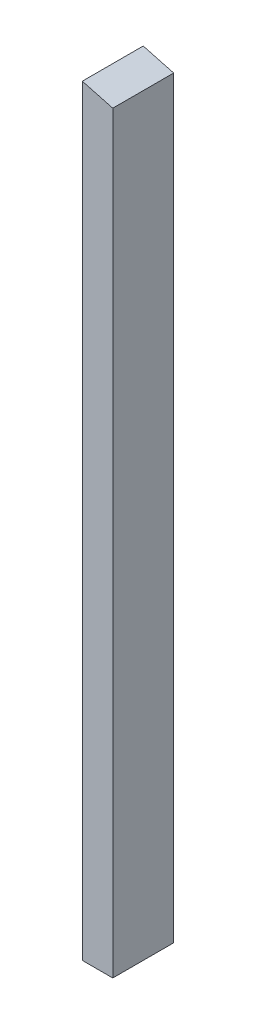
from build123d import *

# Parameters (mm, degrees)
BASE_EXTRUSION_DEPTH = 80
COQUE1_T             = -3


with BuildPart() as part:
    # Esquisse1 → Base-Extrusion (new body)
    with BuildSketch(Plane.XY):
        Polygon((2499.880972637, 3786.406605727), (2539.880972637, 3775.68863803), (2539.880972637, 2786.406605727), (2499.880972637, 2786.406605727), align=None)
    extrude(amount=-BASE_EXTRUSION_DEPTH)

    # Coque1
    coque1_openings = [part.faces().sort_by_distance(p)[0] for p in [
        (2519.880972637, 2786.406605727, -40),
    ]]
    offset(amount=COQUE1_T, openings=coque1_openings, kind=Kind.INTERSECTION)


solid = part.part
